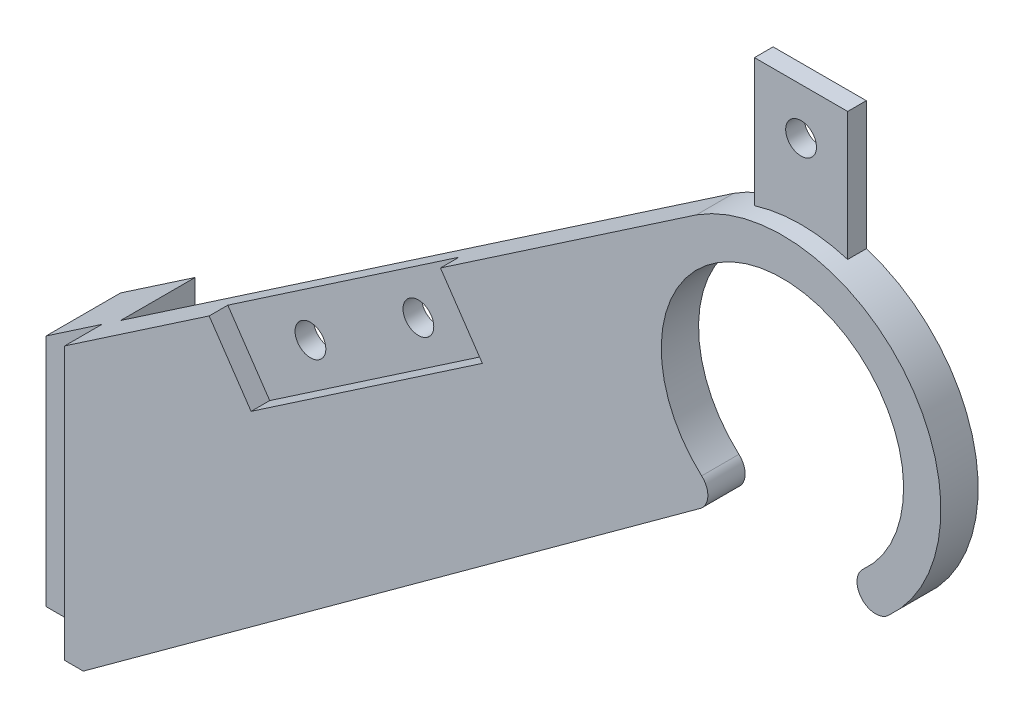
ISO-10303-21;
HEADER;
FILE_DESCRIPTION(('STEP AP214'),'2;1');
FILE_NAME('part.step','',(''),(''),'','','');
FILE_SCHEMA(('AUTOMOTIVE_DESIGN { 1 0 10303 214 1 1 1 1 }'));
ENDSEC;
DATA;
#1=APPLICATION_CONTEXT('core data for automotive mechanical design processes');
#2=APPLICATION_PROTOCOL_DEFINITION('international standard','automotive_design',2000,#1);
#3=PRODUCT_CONTEXT('',#1,'mechanical');
#4=PRODUCT('Part','Part','',(#3));
#5=PRODUCT_RELATED_PRODUCT_CATEGORY('part','',(#4));
#6=PRODUCT_DEFINITION_FORMATION('','',#4);
#7=PRODUCT_DEFINITION_CONTEXT('part definition',#1,'design');
#8=PRODUCT_DEFINITION('design','',#6,#7);
#9=PRODUCT_DEFINITION_SHAPE('','',#8);
#10=(LENGTH_UNIT() NAMED_UNIT(*) SI_UNIT(.MILLI.,.METRE.));
#11=(NAMED_UNIT(*) PLANE_ANGLE_UNIT() SI_UNIT($,.RADIAN.));
#12=(NAMED_UNIT(*) SI_UNIT($,.STERADIAN.) SOLID_ANGLE_UNIT());
#13=UNCERTAINTY_MEASURE_WITH_UNIT(LENGTH_MEASURE(1.E-05),#10,'distance_accuracy_value','');
#14=(GEOMETRIC_REPRESENTATION_CONTEXT(3) GLOBAL_UNCERTAINTY_ASSIGNED_CONTEXT((#13)) GLOBAL_UNIT_ASSIGNED_CONTEXT((#10,
#11,#12)) REPRESENTATION_CONTEXT('',''));
#15=CARTESIAN_POINT('',(0.,0.,0.));
#16=DIRECTION('',(0.,0.,1.));
#17=DIRECTION('',(1.,0.,0.));
#18=AXIS2_PLACEMENT_3D('',#15,#16,#17);
#19=CARTESIAN_POINT('',(-6.00000000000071,12.6393524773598,4.));
#20=DIRECTION('',(1.,0.,0.));
#21=DIRECTION('',(0.,1.,0.));
#22=AXIS2_PLACEMENT_3D('',#19,#20,#21);
#23=PLANE('',#22);
#24=CARTESIAN_POINT('',(-6.00000000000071,-5.86064752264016,-4.));
#25=DIRECTION('',(1.,0.,0.));
#26=DIRECTION('',(0.,0.,-1.));
#27=AXIS2_PLACEMENT_3D('',#24,#25,#26);
#28=CIRCLE('',#27,1.7);
#29=CARTESIAN_POINT('',(-6.00000000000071,-5.86064752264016,-5.7));
#30=VERTEX_POINT('',#29);
#31=EDGE_CURVE('E310',#30,#30,#28,.T.);
#32=ORIENTED_EDGE('',*,*,#31,.T.);
#33=EDGE_LOOP('',(#32));
#34=FACE_BOUND('',#33,.T.);
#35=CARTESIAN_POINT('',(-6.00000000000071,7.13935247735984,-4.));
#36=DIRECTION('',(1.,0.,0.));
#37=DIRECTION('',(0.,0.,-1.));
#38=AXIS2_PLACEMENT_3D('',#35,#36,#37);
#39=CIRCLE('',#38,1.7);
#40=CARTESIAN_POINT('',(-6.00000000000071,7.13935247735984,-5.7));
#41=VERTEX_POINT('',#40);
#42=EDGE_CURVE('E301',#41,#41,#39,.T.);
#43=ORIENTED_EDGE('',*,*,#42,.T.);
#44=EDGE_LOOP('',(#43));
#45=FACE_BOUND('',#44,.T.);
#46=DIRECTION('',(0.,-1.,0.));
#47=VECTOR('',#46,1.);
#48=CARTESIAN_POINT('',(-6.00000000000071,12.6393524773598,0.));
#49=LINE('',#48,#47);
#50=CARTESIAN_POINT('',(-6.00000000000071,12.6393524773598,0.));
#51=VERTEX_POINT('',#50);
#52=CARTESIAN_POINT('',(-6.00000000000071,-12.5000000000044,0.));
#53=VERTEX_POINT('',#52);
#54=EDGE_CURVE('E187',#51,#53,#49,.T.);
#55=ORIENTED_EDGE('',*,*,#54,.F.);
#56=DIRECTION('',(0.,0.,-1.));
#57=VECTOR('',#56,1.);
#58=CARTESIAN_POINT('',(-6.00000000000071,12.6393524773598,4.));
#59=LINE('',#58,#57);
#60=CARTESIAN_POINT('',(-6.00000000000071,12.6393524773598,-8.));
#61=VERTEX_POINT('',#60);
#62=EDGE_CURVE('E239',#51,#61,#59,.T.);
#63=ORIENTED_EDGE('',*,*,#62,.T.);
#64=DIRECTION('',(0.,1.,0.));
#65=VECTOR('',#64,1.);
#66=CARTESIAN_POINT('',(-6.00000000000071,12.6393524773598,-8.));
#67=LINE('',#66,#65);
#68=CARTESIAN_POINT('',(-6.00000000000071,-12.5000000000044,-8.));
#69=VERTEX_POINT('',#68);
#70=EDGE_CURVE('E322',#69,#61,#67,.T.);
#71=ORIENTED_EDGE('',*,*,#70,.F.);
#72=DIRECTION('',(0.,0.,-1.));
#73=VECTOR('',#72,1.);
#74=CARTESIAN_POINT('',(-6.00000000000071,-12.5000000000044,4.));
#75=LINE('',#74,#73);
#76=EDGE_CURVE('E237',#53,#69,#75,.T.);
#77=ORIENTED_EDGE('',*,*,#76,.F.);
#78=EDGE_LOOP('',(#55,#63,#71,#77));
#79=FACE_BOUND('',#78,.T.);
#80=ADVANCED_FACE('F39',(#34,#45,#79),#23,.F.);
#81=CARTESIAN_POINT('',(76.9999999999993,48.4999999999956,4.));
#82=DIRECTION('',(0.,0.,-1.));
#83=DIRECTION('',(-1.,0.,0.));
#84=AXIS2_PLACEMENT_3D('',#81,#82,#83);
#85=CYLINDRICAL_SURFACE('',#84,17.);
#86=DIRECTION('',(0.,0.,-1.));
#87=VECTOR('',#86,1.);
#88=CARTESIAN_POINT('',(81.9999999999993,64.7480768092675,2.));
#89=LINE('',#88,#87);
#90=CARTESIAN_POINT('',(81.9999999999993,64.7480768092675,2.));
#91=VERTEX_POINT('',#90);
#92=CARTESIAN_POINT('',(81.9999999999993,64.7480768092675,0.));
#93=VERTEX_POINT('',#92);
#94=EDGE_CURVE('E408',#91,#93,#89,.T.);
#95=ORIENTED_EDGE('',*,*,#94,.F.);
#96=CARTESIAN_POINT('',(76.9999999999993,48.4999999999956,2.));
#97=DIRECTION('',(0.,0.,-1.));
#98=DIRECTION('',(1.,0.,0.));
#99=AXIS2_PLACEMENT_3D('',#96,#97,#98);
#100=CIRCLE('',#99,17.);
#101=CARTESIAN_POINT('',(71.9999999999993,64.7480768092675,2.));
#102=VERTEX_POINT('',#101);
#103=EDGE_CURVE('E62',#102,#91,#100,.T.);
#104=ORIENTED_EDGE('',*,*,#103,.F.);
#105=DIRECTION('',(0.,0.,-1.));
#106=VECTOR('',#105,1.);
#107=CARTESIAN_POINT('',(71.9999999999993,64.7480768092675,2.));
#108=LINE('',#107,#106);
#109=CARTESIAN_POINT('',(71.9999999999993,64.7480768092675,0.));
#110=VERTEX_POINT('',#109);
#111=EDGE_CURVE('E416',#102,#110,#108,.T.);
#112=ORIENTED_EDGE('',*,*,#111,.T.);
#113=CARTESIAN_POINT('',(76.9999999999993,48.4999999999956,0.));
#114=DIRECTION('',(0.,0.,1.));
#115=DIRECTION('',(1.,0.,0.));
#116=AXIS2_PLACEMENT_3D('',#113,#114,#115);
#117=CIRCLE('',#116,17.);
#118=CARTESIAN_POINT('',(67.7706376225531,62.7765146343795,0.));
#119=VERTEX_POINT('',#118);
#120=EDGE_CURVE('E213',#110,#119,#117,.T.);
#121=ORIENTED_EDGE('',*,*,#120,.T.);
#122=DIRECTION('',(0.,0.,-1.));
#123=VECTOR('',#122,1.);
#124=CARTESIAN_POINT('',(67.7706376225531,62.7765146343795,4.));
#125=LINE('',#124,#123);
#126=CARTESIAN_POINT('',(67.7706376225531,62.7765146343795,4.));
#127=VERTEX_POINT('',#126);
#128=EDGE_CURVE('E241',#127,#119,#125,.T.);
#129=ORIENTED_EDGE('',*,*,#128,.F.);
#130=CARTESIAN_POINT('',(76.9999999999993,48.4999999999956,4.));
#131=DIRECTION('',(0.,0.,1.));
#132=DIRECTION('',(1.,0.,0.));
#133=AXIS2_PLACEMENT_3D('',#130,#131,#132);
#134=CIRCLE('',#133,17.);
#135=CARTESIAN_POINT('',(88.3333333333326,35.8289481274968,4.));
#136=VERTEX_POINT('',#135);
#137=EDGE_CURVE('E194',#136,#127,#134,.T.);
#138=ORIENTED_EDGE('',*,*,#137,.F.);
#139=DIRECTION('',(0.,0.,-1.));
#140=VECTOR('',#139,1.);
#141=CARTESIAN_POINT('',(88.3333333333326,35.8289481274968,4.));
#142=LINE('',#141,#140);
#143=CARTESIAN_POINT('',(88.3333333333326,35.8289481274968,0.));
#144=VERTEX_POINT('',#143);
#145=EDGE_CURVE('E178',#136,#144,#142,.T.);
#146=ORIENTED_EDGE('',*,*,#145,.T.);
#147=EDGE_CURVE('E215',#144,#93,#117,.T.);
#148=ORIENTED_EDGE('',*,*,#147,.T.);
#149=EDGE_LOOP('',(#95,#104,#112,#121,#129,#138,#146,#148));
#150=FACE_BOUND('',#149,.T.);
#151=ADVANCED_FACE('F339',(#150),#85,.T.);
#152=CARTESIAN_POINT('',(0.,0.,2.));
#153=DIRECTION('',(0.,0.,-1.));
#154=DIRECTION('',(-1.,0.,0.));
#155=AXIS2_PLACEMENT_3D('',#152,#153,#154);
#156=PLANE('',#155);
#157=CARTESIAN_POINT('',(24.3681164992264,28.4422397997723,2.));
#158=DIRECTION('',(0.,0.,1.));
#159=DIRECTION('',(1.,0.,0.));
#160=AXIS2_PLACEMENT_3D('',#157,#158,#159);
#161=CIRCLE('',#160,1.65);
#162=CARTESIAN_POINT('',(26.0181164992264,28.4422397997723,2.));
#163=VERTEX_POINT('',#162);
#164=EDGE_CURVE('E249',#163,#163,#161,.T.);
#165=ORIENTED_EDGE('',*,*,#164,.F.);
#166=EDGE_LOOP('',(#165));
#167=FACE_BOUND('',#166,.T.);
#168=DIRECTION('',(0.56210399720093,-0.827066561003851,0.));
#169=VECTOR('',#168,1.);
#170=CARTESIAN_POINT('',(19.9999999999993,20.6371415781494,2.));
#171=LINE('',#170,#169);
#172=CARTESIAN_POINT('',(15.5031680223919,27.2536740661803,2.));
#173=VERTEX_POINT('',#172);
#174=CARTESIAN_POINT('',(19.9999999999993,20.6371415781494,2.));
#175=VERTEX_POINT('',#174);
#176=EDGE_CURVE('E267',#173,#175,#171,.T.);
#177=ORIENTED_EDGE('',*,*,#176,.T.);
#178=DIRECTION('',(0.827066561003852,0.562103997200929,0.));
#179=VECTOR('',#178,1.);
#180=CARTESIAN_POINT('',(44.8119968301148,37.5002614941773,2.));
#181=LINE('',#180,#179);
#182=CARTESIAN_POINT('',(44.8119968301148,37.5002614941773,2.));
#183=VERTEX_POINT('',#182);
#184=EDGE_CURVE('E270',#175,#183,#181,.T.);
#185=ORIENTED_EDGE('',*,*,#184,.T.);
#186=DIRECTION('',(-0.562103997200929,0.827066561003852,0.));
#187=VECTOR('',#186,1.);
#188=CARTESIAN_POINT('',(40.3151648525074,44.1167939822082,2.));
#189=LINE('',#188,#187);
#190=CARTESIAN_POINT('',(40.3151648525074,44.1167939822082,2.));
#191=VERTEX_POINT('',#190);
#192=EDGE_CURVE('E274',#183,#191,#189,.T.);
#193=ORIENTED_EDGE('',*,*,#192,.T.);
#194=DIRECTION('',(-0.827066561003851,-0.56210399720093,0.));
#195=VECTOR('',#194,1.);
#196=CARTESIAN_POINT('',(15.5031680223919,27.2536740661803,2.));
#197=LINE('',#196,#195);
#198=EDGE_CURVE('E277',#191,#173,#197,.T.);
#199=ORIENTED_EDGE('',*,*,#198,.T.);
#200=EDGE_LOOP('',(#177,#185,#193,#199));
#201=FACE_BOUND('',#200,.T.);
#202=CARTESIAN_POINT('',(35.9470483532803,36.3116957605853,2.));
#203=DIRECTION('',(0.,0.,1.));
#204=DIRECTION('',(1.,0.,0.));
#205=AXIS2_PLACEMENT_3D('',#202,#203,#204);
#206=CIRCLE('',#205,1.65);
#207=CARTESIAN_POINT('',(37.5970483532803,36.3116957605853,2.));
#208=VERTEX_POINT('',#207);
#209=EDGE_CURVE('E248',#208,#208,#206,.T.);
#210=ORIENTED_EDGE('',*,*,#209,.F.);
#211=EDGE_LOOP('',(#210));
#212=FACE_BOUND('',#211,.T.);
#213=ADVANCED_FACE('F354',(#167,#201,#212),#156,.F.);
#214=CARTESIAN_POINT('',(86.9999999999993,37.3196601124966,0.));
#215=DIRECTION('',(0.,0.,1.));
#216=DIRECTION('',(1.,0.,0.));
#217=AXIS2_PLACEMENT_3D('',#214,#215,#216);
#218=PLANE('',#217);
#219=CARTESIAN_POINT('',(76.9999999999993,73.4999999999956,0.));
#220=DIRECTION('',(0.,0.,1.));
#221=DIRECTION('',(1.,0.,0.));
#222=AXIS2_PLACEMENT_3D('',#219,#220,#221);
#223=CIRCLE('',#222,1.64999999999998);
#224=CARTESIAN_POINT('',(78.6499999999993,73.4999999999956,0.));
#225=VERTEX_POINT('',#224);
#226=EDGE_CURVE('E395',#225,#225,#223,.T.);
#227=ORIENTED_EDGE('',*,*,#226,.T.);
#228=EDGE_LOOP('',(#227));
#229=FACE_BOUND('',#228,.T.);
#230=CARTESIAN_POINT('',(24.3681164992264,28.4422397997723,0.));
#231=DIRECTION('',(0.,0.,1.));
#232=DIRECTION('',(1.,0.,0.));
#233=AXIS2_PLACEMENT_3D('',#230,#231,#232);
#234=CIRCLE('',#233,1.65);
#235=CARTESIAN_POINT('',(26.0181164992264,28.4422397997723,0.));
#236=VERTEX_POINT('',#235);
#237=EDGE_CURVE('E246',#236,#236,#234,.T.);
#238=ORIENTED_EDGE('',*,*,#237,.T.);
#239=EDGE_LOOP('',(#238));
#240=FACE_BOUND('',#239,.T.);
#241=CARTESIAN_POINT('',(35.9470483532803,36.3116957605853,0.));
#242=DIRECTION('',(0.,0.,1.));
#243=DIRECTION('',(1.,0.,0.));
#244=AXIS2_PLACEMENT_3D('',#241,#242,#243);
#245=CIRCLE('',#244,1.65);
#246=CARTESIAN_POINT('',(37.5970483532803,36.3116957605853,0.));
#247=VERTEX_POINT('',#246);
#248=EDGE_CURVE('E253',#247,#247,#245,.T.);
#249=ORIENTED_EDGE('',*,*,#248,.T.);
#250=EDGE_LOOP('',(#249));
#251=FACE_BOUND('',#250,.T.);
#252=DIRECTION('',(0.,-1.,0.));
#253=VECTOR('',#252,1.);
#254=CARTESIAN_POINT('',(1.99999999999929,12.6393524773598,0.));
#255=LINE('',#254,#253);
#256=CARTESIAN_POINT('',(1.99999999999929,18.0764384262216,0.));
#257=VERTEX_POINT('',#256);
#258=CARTESIAN_POINT('',(1.99999999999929,-12.5000000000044,0.));
#259=VERTEX_POINT('',#258);
#260=EDGE_CURVE('E313',#257,#259,#255,.T.);
#261=ORIENTED_EDGE('',*,*,#260,.F.);
#262=DIRECTION('',(-0.827066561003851,-0.562103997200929,0.));
#263=VECTOR('',#262,1.);
#264=CARTESIAN_POINT('',(-6.00000000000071,12.6393524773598,0.));
#265=LINE('',#264,#263);
#266=EDGE_CURVE('E217',#119,#257,#265,.T.);
#267=ORIENTED_EDGE('',*,*,#266,.F.);
#268=ORIENTED_EDGE('',*,*,#120,.F.);
#269=DIRECTION('',(0.,-1.,0.));
#270=VECTOR('',#269,1.);
#271=CARTESIAN_POINT('',(71.9999999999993,64.7480768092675,0.));
#272=LINE('',#271,#270);
#273=CARTESIAN_POINT('',(71.9999999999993,78.4999999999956,0.));
#274=VERTEX_POINT('',#273);
#275=EDGE_CURVE('E403',#274,#110,#272,.T.);
#276=ORIENTED_EDGE('',*,*,#275,.F.);
#277=DIRECTION('',(-1.,0.,0.));
#278=VECTOR('',#277,1.);
#279=CARTESIAN_POINT('',(71.9999999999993,78.4999999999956,0.));
#280=LINE('',#279,#278);
#281=CARTESIAN_POINT('',(81.9999999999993,78.4999999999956,0.));
#282=VERTEX_POINT('',#281);
#283=EDGE_CURVE('E411',#282,#274,#280,.T.);
#284=ORIENTED_EDGE('',*,*,#283,.F.);
#285=DIRECTION('',(0.,1.,0.));
#286=VECTOR('',#285,1.);
#287=CARTESIAN_POINT('',(81.9999999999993,64.7480768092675,0.));
#288=LINE('',#287,#286);
#289=EDGE_CURVE('E398',#93,#282,#288,.T.);
#290=ORIENTED_EDGE('',*,*,#289,.F.);
#291=ORIENTED_EDGE('',*,*,#147,.F.);
#292=CARTESIAN_POINT('',(86.9999999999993,37.3196601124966,0.));
#293=DIRECTION('',(0.,0.,1.));
#294=DIRECTION('',(1.,0.,0.));
#295=AXIS2_PLACEMENT_3D('',#292,#293,#294);
#296=CIRCLE('',#295,2.00000000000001);
#297=CARTESIAN_POINT('',(85.666666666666,38.8103720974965,0.));
#298=VERTEX_POINT('',#297);
#299=EDGE_CURVE('E210',#298,#144,#296,.T.);
#300=ORIENTED_EDGE('',*,*,#299,.F.);
#301=CARTESIAN_POINT('',(76.9999999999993,48.4999999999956,0.));
#302=DIRECTION('',(0.,0.,-1.));
#303=DIRECTION('',(1.,0.,0.));
#304=AXIS2_PLACEMENT_3D('',#301,#302,#303);
#305=CIRCLE('',#304,13.);
#306=CARTESIAN_POINT('',(68.3333333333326,38.8103720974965,0.));
#307=VERTEX_POINT('',#306);
#308=EDGE_CURVE('E224',#307,#298,#305,.T.);
#309=ORIENTED_EDGE('',*,*,#308,.F.);
#310=CARTESIAN_POINT('',(66.9999999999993,37.3196601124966,0.));
#311=DIRECTION('',(0.,0.,1.));
#312=DIRECTION('',(1.,0.,0.));
#313=AXIS2_PLACEMENT_3D('',#310,#311,#312);
#314=CIRCLE('',#313,2.);
#315=CARTESIAN_POINT('',(68.177524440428,35.7030475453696,0.));
#316=VERTEX_POINT('',#315);
#317=EDGE_CURVE('E222',#316,#307,#314,.T.);
#318=ORIENTED_EDGE('',*,*,#317,.F.);
#319=DIRECTION('',(0.808306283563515,0.588762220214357,0.));
#320=VECTOR('',#319,1.);
#321=CARTESIAN_POINT('',(1.99999999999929,-12.5000000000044,0.));
#322=LINE('',#321,#320);
#323=EDGE_CURVE('E220',#259,#316,#322,.T.);
#324=ORIENTED_EDGE('',*,*,#323,.F.);
#325=EDGE_LOOP('',(#261,#267,#268,#276,#284,#290,#291,#300,#309,#318,#324));
#326=FACE_BOUND('',#325,.T.);
#327=ADVANCED_FACE('F357',(#229,#240,#251,#326),#218,.F.);
#328=CARTESIAN_POINT('',(86.9999999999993,37.3196601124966,4.));
#329=DIRECTION('',(0.,0.,-1.));
#330=DIRECTION('',(-1.,0.,0.));
#331=AXIS2_PLACEMENT_3D('',#328,#329,#330);
#332=CYLINDRICAL_SURFACE('',#331,2.00000000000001);
#333=ORIENTED_EDGE('',*,*,#299,.T.);
#334=ORIENTED_EDGE('',*,*,#145,.F.);
#335=CARTESIAN_POINT('',(86.9999999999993,37.3196601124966,4.));
#336=DIRECTION('',(0.,0.,1.));
#337=DIRECTION('',(1.,0.,0.));
#338=AXIS2_PLACEMENT_3D('',#335,#336,#337);
#339=CIRCLE('',#338,2.00000000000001);
#340=CARTESIAN_POINT('',(85.666666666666,38.8103720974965,4.));
#341=VERTEX_POINT('',#340);
#342=EDGE_CURVE('E198',#341,#136,#339,.T.);
#343=ORIENTED_EDGE('',*,*,#342,.F.);
#344=DIRECTION('',(0.,0.,-1.));
#345=VECTOR('',#344,1.);
#346=CARTESIAN_POINT('',(85.666666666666,38.8103720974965,4.));
#347=LINE('',#346,#345);
#348=EDGE_CURVE('E209',#341,#298,#347,.T.);
#349=ORIENTED_EDGE('',*,*,#348,.T.);
#350=EDGE_LOOP('',(#333,#334,#343,#349));
#351=FACE_BOUND('',#350,.T.);
#352=ADVANCED_FACE('F41',(#351),#332,.T.);
#353=CARTESIAN_POINT('',(-6.00000000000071,12.6393524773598,4.));
#354=DIRECTION('',(0.562103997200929,-0.827066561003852,0.));
#355=DIRECTION('',(0.827066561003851,0.562103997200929,0.));
#356=AXIS2_PLACEMENT_3D('',#353,#354,#355);
#357=PLANE('',#356);
#358=DIRECTION('',(-0.827066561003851,-0.562103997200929,0.));
#359=VECTOR('',#358,1.);
#360=CARTESIAN_POINT('',(-6.00000000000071,12.6393524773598,0.));
#361=LINE('',#360,#359);
#362=CARTESIAN_POINT('',(0.,16.7171669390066,0.));
#363=VERTEX_POINT('',#362);
#364=EDGE_CURVE('E186',#363,#51,#361,.T.);
#365=ORIENTED_EDGE('',*,*,#364,.F.);
#366=DIRECTION('',(0.,0.,1.));
#367=VECTOR('',#366,1.);
#368=CARTESIAN_POINT('',(0.,16.7171669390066,4.));
#369=LINE('',#368,#367);
#370=CARTESIAN_POINT('',(0.,16.7171669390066,4.));
#371=VERTEX_POINT('',#370);
#372=EDGE_CURVE('E173',#363,#371,#369,.T.);
#373=ORIENTED_EDGE('',*,*,#372,.T.);
#374=DIRECTION('',(-0.827066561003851,-0.562103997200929,0.));
#375=VECTOR('',#374,1.);
#376=CARTESIAN_POINT('',(-6.00000000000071,12.6393524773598,4.));
#377=LINE('',#376,#375);
#378=CARTESIAN_POINT('',(15.5031680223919,27.2536740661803,4.));
#379=VERTEX_POINT('',#378);
#380=EDGE_CURVE('E184',#379,#371,#377,.T.);
#381=ORIENTED_EDGE('',*,*,#380,.F.);
#382=DIRECTION('',(0.,0.,1.));
#383=VECTOR('',#382,1.);
#384=CARTESIAN_POINT('',(15.5031680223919,27.2536740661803,2.));
#385=LINE('',#384,#383);
#386=EDGE_CURVE('E286',#173,#379,#385,.T.);
#387=ORIENTED_EDGE('',*,*,#386,.F.);
#388=ORIENTED_EDGE('',*,*,#198,.F.);
#389=DIRECTION('',(0.,0.,1.));
#390=VECTOR('',#389,1.);
#391=CARTESIAN_POINT('',(40.3151648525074,44.1167939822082,2.));
#392=LINE('',#391,#390);
#393=CARTESIAN_POINT('',(40.3151648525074,44.1167939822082,4.));
#394=VERTEX_POINT('',#393);
#395=EDGE_CURVE('E289',#191,#394,#392,.T.);
#396=ORIENTED_EDGE('',*,*,#395,.T.);
#397=EDGE_CURVE('E193',#127,#394,#377,.T.);
#398=ORIENTED_EDGE('',*,*,#397,.F.);
#399=ORIENTED_EDGE('',*,*,#128,.T.);
#400=ORIENTED_EDGE('',*,*,#266,.T.);
#401=DIRECTION('',(0.,0.,1.));
#402=VECTOR('',#401,1.);
#403=CARTESIAN_POINT('',(1.9999999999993,18.0764384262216,-8.));
#404=LINE('',#403,#402);
#405=CARTESIAN_POINT('',(1.9999999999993,18.0764384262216,-8.));
#406=VERTEX_POINT('',#405);
#407=EDGE_CURVE('E214',#406,#257,#404,.T.);
#408=ORIENTED_EDGE('',*,*,#407,.F.);
#409=DIRECTION('',(0.827066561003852,0.562103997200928,0.));
#410=VECTOR('',#409,1.);
#411=CARTESIAN_POINT('',(1.9999999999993,18.0764384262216,-8.));
#412=LINE('',#411,#410);
#413=EDGE_CURVE('E314',#61,#406,#412,.T.);
#414=ORIENTED_EDGE('',*,*,#413,.F.);
#415=ORIENTED_EDGE('',*,*,#62,.F.);
#416=EDGE_LOOP('',(#365,#373,#381,#387,#388,#396,#398,#399,#400,#408,#414,#415));
#417=FACE_BOUND('',#416,.T.);
#418=ADVANCED_FACE('F182',(#417),#357,.F.);
#419=CARTESIAN_POINT('',(-6.00000000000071,-12.5000000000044,4.));
#420=DIRECTION('',(0.,1.,0.));
#421=DIRECTION('',(-1.,0.,0.));
#422=AXIS2_PLACEMENT_3D('',#419,#420,#421);
#423=PLANE('',#422);
#424=DIRECTION('',(1.,0.,0.));
#425=VECTOR('',#424,1.);
#426=CARTESIAN_POINT('',(-6.00000000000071,-12.5000000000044,4.));
#427=LINE('',#426,#425);
#428=CARTESIAN_POINT('',(0.,-12.5000000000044,4.));
#429=VERTEX_POINT('',#428);
#430=CARTESIAN_POINT('',(1.99999999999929,-12.5000000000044,4.));
#431=VERTEX_POINT('',#430);
#432=EDGE_CURVE('E197',#429,#431,#427,.T.);
#433=ORIENTED_EDGE('',*,*,#432,.F.);
#434=DIRECTION('',(0.,0.,-1.));
#435=VECTOR('',#434,1.);
#436=CARTESIAN_POINT('',(0.,-12.5000000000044,4.));
#437=LINE('',#436,#435);
#438=CARTESIAN_POINT('',(0.,-12.5000000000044,0.));
#439=VERTEX_POINT('',#438);
#440=EDGE_CURVE('E54',#429,#439,#437,.T.);
#441=ORIENTED_EDGE('',*,*,#440,.T.);
#442=DIRECTION('',(1.,0.,0.));
#443=VECTOR('',#442,1.);
#444=CARTESIAN_POINT('',(-6.00000000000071,-12.5000000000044,0.));
#445=LINE('',#444,#443);
#446=EDGE_CURVE('E12',#53,#439,#445,.T.);
#447=ORIENTED_EDGE('',*,*,#446,.F.);
#448=ORIENTED_EDGE('',*,*,#76,.T.);
#449=DIRECTION('',(-1.,0.,0.));
#450=VECTOR('',#449,1.);
#451=CARTESIAN_POINT('',(-6.00000000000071,-12.5000000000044,-8.));
#452=LINE('',#451,#450);
#453=CARTESIAN_POINT('',(1.99999999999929,-12.5000000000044,-8.));
#454=VERTEX_POINT('',#453);
#455=EDGE_CURVE('E319',#454,#69,#452,.T.);
#456=ORIENTED_EDGE('',*,*,#455,.F.);
#457=DIRECTION('',(0.,0.,1.));
#458=VECTOR('',#457,1.);
#459=CARTESIAN_POINT('',(1.99999999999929,-12.5000000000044,-8.));
#460=LINE('',#459,#458);
#461=EDGE_CURVE('E325',#454,#259,#460,.T.);
#462=ORIENTED_EDGE('',*,*,#461,.T.);
#463=DIRECTION('',(0.,0.,-1.));
#464=VECTOR('',#463,1.);
#465=CARTESIAN_POINT('',(1.99999999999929,-12.5000000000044,4.));
#466=LINE('',#465,#464);
#467=EDGE_CURVE('E234',#431,#259,#466,.T.);
#468=ORIENTED_EDGE('',*,*,#467,.F.);
#469=EDGE_LOOP('',(#433,#441,#447,#448,#456,#462,#468));
#470=FACE_BOUND('',#469,.T.);
#471=ADVANCED_FACE('F457',(#470),#423,.F.);
#472=CARTESIAN_POINT('',(1.99999999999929,-12.5000000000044,4.));
#473=DIRECTION('',(-0.588762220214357,0.808306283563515,0.));
#474=DIRECTION('',(-0.808306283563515,-0.588762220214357,0.));
#475=AXIS2_PLACEMENT_3D('',#472,#473,#474);
#476=PLANE('',#475);
#477=ORIENTED_EDGE('',*,*,#323,.T.);
#478=DIRECTION('',(0.,0.,-1.));
#479=VECTOR('',#478,1.);
#480=CARTESIAN_POINT('',(68.177524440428,35.7030475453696,4.));
#481=LINE('',#480,#479);
#482=CARTESIAN_POINT('',(68.177524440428,35.7030475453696,4.));
#483=VERTEX_POINT('',#482);
#484=EDGE_CURVE('E231',#483,#316,#481,.T.);
#485=ORIENTED_EDGE('',*,*,#484,.F.);
#486=DIRECTION('',(0.808306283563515,0.588762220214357,0.));
#487=VECTOR('',#486,1.);
#488=CARTESIAN_POINT('',(1.99999999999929,-12.5000000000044,4.));
#489=LINE('',#488,#487);
#490=EDGE_CURVE('E203',#431,#483,#489,.T.);
#491=ORIENTED_EDGE('',*,*,#490,.F.);
#492=ORIENTED_EDGE('',*,*,#467,.T.);
#493=EDGE_LOOP('',(#477,#485,#491,#492));
#494=FACE_BOUND('',#493,.T.);
#495=ADVANCED_FACE('F462',(#494),#476,.F.);
#496=CARTESIAN_POINT('',(66.9999999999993,37.3196601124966,4.));
#497=DIRECTION('',(0.,0.,-1.));
#498=DIRECTION('',(-1.,0.,0.));
#499=AXIS2_PLACEMENT_3D('',#496,#497,#498);
#500=CYLINDRICAL_SURFACE('',#499,2.);
#501=ORIENTED_EDGE('',*,*,#317,.T.);
#502=DIRECTION('',(0.,0.,-1.));
#503=VECTOR('',#502,1.);
#504=CARTESIAN_POINT('',(68.3333333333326,38.8103720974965,4.));
#505=LINE('',#504,#503);
#506=CARTESIAN_POINT('',(68.3333333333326,38.8103720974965,4.));
#507=VERTEX_POINT('',#506);
#508=EDGE_CURVE('E228',#507,#307,#505,.T.);
#509=ORIENTED_EDGE('',*,*,#508,.F.);
#510=CARTESIAN_POINT('',(66.9999999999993,37.3196601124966,4.));
#511=DIRECTION('',(0.,0.,1.));
#512=DIRECTION('',(1.,0.,0.));
#513=AXIS2_PLACEMENT_3D('',#510,#511,#512);
#514=CIRCLE('',#513,2.);
#515=EDGE_CURVE('E205',#483,#507,#514,.T.);
#516=ORIENTED_EDGE('',*,*,#515,.F.);
#517=ORIENTED_EDGE('',*,*,#484,.T.);
#518=EDGE_LOOP('',(#501,#509,#516,#517));
#519=FACE_BOUND('',#518,.T.);
#520=ADVANCED_FACE('F490',(#519),#500,.T.);
#521=CARTESIAN_POINT('',(76.9999999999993,48.4999999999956,4.));
#522=DIRECTION('',(0.,0.,-1.));
#523=DIRECTION('',(-1.,0.,0.));
#524=AXIS2_PLACEMENT_3D('',#521,#522,#523);
#525=CYLINDRICAL_SURFACE('',#524,13.);
#526=ORIENTED_EDGE('',*,*,#308,.T.);
#527=ORIENTED_EDGE('',*,*,#348,.F.);
#528=CARTESIAN_POINT('',(76.9999999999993,48.4999999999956,4.));
#529=DIRECTION('',(0.,0.,-1.));
#530=DIRECTION('',(1.,0.,0.));
#531=AXIS2_PLACEMENT_3D('',#528,#529,#530);
#532=CIRCLE('',#531,13.);
#533=EDGE_CURVE('E207',#507,#341,#532,.T.);
#534=ORIENTED_EDGE('',*,*,#533,.F.);
#535=ORIENTED_EDGE('',*,*,#508,.T.);
#536=EDGE_LOOP('',(#526,#527,#534,#535));
#537=FACE_BOUND('',#536,.T.);
#538=ADVANCED_FACE('F497',(#537),#525,.F.);
#539=CARTESIAN_POINT('',(86.9999999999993,37.3196601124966,4.));
#540=DIRECTION('',(0.,0.,1.));
#541=DIRECTION('',(1.,0.,0.));
#542=AXIS2_PLACEMENT_3D('',#539,#540,#541);
#543=PLANE('',#542);
#544=DIRECTION('',(0.,1.,0.));
#545=VECTOR('',#544,1.);
#546=CARTESIAN_POINT('',(0.,37.3196601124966,4.));
#547=LINE('',#546,#545);
#548=EDGE_CURVE('E47',#429,#371,#547,.T.);
#549=ORIENTED_EDGE('',*,*,#548,.F.);
#550=ORIENTED_EDGE('',*,*,#432,.T.);
#551=ORIENTED_EDGE('',*,*,#490,.T.);
#552=ORIENTED_EDGE('',*,*,#515,.T.);
#553=ORIENTED_EDGE('',*,*,#533,.T.);
#554=ORIENTED_EDGE('',*,*,#342,.T.);
#555=ORIENTED_EDGE('',*,*,#137,.T.);
#556=ORIENTED_EDGE('',*,*,#397,.T.);
#557=DIRECTION('',(-0.562103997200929,0.827066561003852,0.));
#558=VECTOR('',#557,1.);
#559=CARTESIAN_POINT('',(40.3151648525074,44.1167939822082,4.));
#560=LINE('',#559,#558);
#561=CARTESIAN_POINT('',(44.8119968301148,37.5002614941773,4.));
#562=VERTEX_POINT('',#561);
#563=EDGE_CURVE('E271',#562,#394,#560,.T.);
#564=ORIENTED_EDGE('',*,*,#563,.F.);
#565=DIRECTION('',(0.827066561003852,0.562103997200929,0.));
#566=VECTOR('',#565,1.);
#567=CARTESIAN_POINT('',(44.8119968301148,37.5002614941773,4.));
#568=LINE('',#567,#566);
#569=CARTESIAN_POINT('',(19.9999999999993,20.6371415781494,4.));
#570=VERTEX_POINT('',#569);
#571=EDGE_CURVE('E282',#570,#562,#568,.T.);
#572=ORIENTED_EDGE('',*,*,#571,.F.);
#573=DIRECTION('',(0.56210399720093,-0.827066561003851,0.));
#574=VECTOR('',#573,1.);
#575=CARTESIAN_POINT('',(19.9999999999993,20.6371415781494,4.));
#576=LINE('',#575,#574);
#577=EDGE_CURVE('E192',#379,#570,#576,.T.);
#578=ORIENTED_EDGE('',*,*,#577,.F.);
#579=ORIENTED_EDGE('',*,*,#380,.T.);
#580=EDGE_LOOP('',(#549,#550,#551,#552,#553,#554,#555,#556,#564,#572,#578,#579));
#581=FACE_BOUND('',#580,.T.);
#582=ADVANCED_FACE('F190',(#581),#543,.T.);
#583=CARTESIAN_POINT('',(1.99999999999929,12.6393524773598,-8.));
#584=DIRECTION('',(-1.,0.,0.));
#585=DIRECTION('',(0.,0.,1.));
#586=AXIS2_PLACEMENT_3D('',#583,#584,#585);
#587=PLANE('',#586);
#588=CARTESIAN_POINT('',(1.99999999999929,7.13935247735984,-4.));
#589=DIRECTION('',(1.,0.,0.));
#590=DIRECTION('',(0.,0.,-1.));
#591=AXIS2_PLACEMENT_3D('',#588,#589,#590);
#592=CIRCLE('',#591,3.3);
#593=CARTESIAN_POINT('',(1.99999999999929,7.13935247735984,-7.3));
#594=VERTEX_POINT('',#593);
#595=EDGE_CURVE('E288',#594,#594,#592,.T.);
#596=ORIENTED_EDGE('',*,*,#595,.F.);
#597=EDGE_LOOP('',(#596));
#598=FACE_BOUND('',#597,.T.);
#599=CARTESIAN_POINT('',(1.99999999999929,-5.86064752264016,-4.));
#600=DIRECTION('',(1.,0.,0.));
#601=DIRECTION('',(0.,0.,-1.));
#602=AXIS2_PLACEMENT_3D('',#599,#600,#601);
#603=CIRCLE('',#602,3.3);
#604=CARTESIAN_POINT('',(1.99999999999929,-5.86064752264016,-7.3));
#605=VERTEX_POINT('',#604);
#606=EDGE_CURVE('E304',#605,#605,#603,.T.);
#607=ORIENTED_EDGE('',*,*,#606,.F.);
#608=EDGE_LOOP('',(#607));
#609=FACE_BOUND('',#608,.T.);
#610=ORIENTED_EDGE('',*,*,#260,.T.);
#611=ORIENTED_EDGE('',*,*,#461,.F.);
#612=DIRECTION('',(0.,-1.,0.));
#613=VECTOR('',#612,1.);
#614=CARTESIAN_POINT('',(1.99999999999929,12.6393524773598,-8.));
#615=LINE('',#614,#613);
#616=EDGE_CURVE('E317',#406,#454,#615,.T.);
#617=ORIENTED_EDGE('',*,*,#616,.F.);
#618=ORIENTED_EDGE('',*,*,#407,.T.);
#619=EDGE_LOOP('',(#610,#611,#617,#618));
#620=FACE_BOUND('',#619,.T.);
#621=ADVANCED_FACE('F378',(#598,#609,#620),#587,.F.);
#622=CARTESIAN_POINT('',(0.,0.,-8.));
#623=DIRECTION('',(0.,0.,1.));
#624=DIRECTION('',(1.,0.,0.));
#625=AXIS2_PLACEMENT_3D('',#622,#623,#624);
#626=PLANE('',#625);
#627=ORIENTED_EDGE('',*,*,#413,.T.);
#628=ORIENTED_EDGE('',*,*,#616,.T.);
#629=ORIENTED_EDGE('',*,*,#455,.T.);
#630=ORIENTED_EDGE('',*,*,#70,.T.);
#631=EDGE_LOOP('',(#627,#628,#629,#630));
#632=FACE_BOUND('',#631,.T.);
#633=ADVANCED_FACE('F381',(#632),#626,.F.);
#634=CARTESIAN_POINT('',(1.99999999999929,-5.86064752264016,-4.));
#635=DIRECTION('',(1.,0.,0.));
#636=DIRECTION('',(0.,0.,-1.));
#637=AXIS2_PLACEMENT_3D('',#634,#635,#636);
#638=CYLINDRICAL_SURFACE('',#637,1.69999999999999);
#639=ORIENTED_EDGE('',*,*,#31,.F.);
#640=EDGE_LOOP('',(#639));
#641=FACE_BOUND('',#640,.T.);
#642=CARTESIAN_POINT('',(0.399999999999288,-5.86064752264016,-4.));
#643=DIRECTION('',(1.,0.,0.));
#644=DIRECTION('',(0.,0.,-1.));
#645=AXIS2_PLACEMENT_3D('',#642,#643,#644);
#646=CIRCLE('',#645,1.69999999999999);
#647=CARTESIAN_POINT('',(0.399999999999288,-5.86064752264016,-5.69999999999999));
#648=VERTEX_POINT('',#647);
#649=EDGE_CURVE('E307',#648,#648,#646,.T.);
#650=ORIENTED_EDGE('',*,*,#649,.T.);
#651=EDGE_LOOP('',(#650));
#652=FACE_BOUND('',#651,.T.);
#653=ADVANCED_FACE('F529',(#641,#652),#638,.F.);
#654=CARTESIAN_POINT('',(1.99999999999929,-5.86064752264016,-4.));
#655=DIRECTION('',(1.,0.,0.));
#656=DIRECTION('',(0.,0.,-1.));
#657=AXIS2_PLACEMENT_3D('',#654,#655,#656);
#658=CONICAL_SURFACE('',#657,3.3,0.78539816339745);
#659=ORIENTED_EDGE('',*,*,#649,.F.);
#660=EDGE_LOOP('',(#659));
#661=FACE_BOUND('',#660,.T.);
#662=ORIENTED_EDGE('',*,*,#606,.T.);
#663=EDGE_LOOP('',(#662));
#664=FACE_BOUND('',#663,.T.);
#665=ADVANCED_FACE('F535',(#661,#664),#658,.F.);
#666=CARTESIAN_POINT('',(1.99999999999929,7.13935247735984,-4.));
#667=DIRECTION('',(1.,0.,0.));
#668=DIRECTION('',(0.,0.,-1.));
#669=AXIS2_PLACEMENT_3D('',#666,#667,#668);
#670=CYLINDRICAL_SURFACE('',#669,1.69999999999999);
#671=ORIENTED_EDGE('',*,*,#42,.F.);
#672=EDGE_LOOP('',(#671));
#673=FACE_BOUND('',#672,.T.);
#674=CARTESIAN_POINT('',(0.399999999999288,7.13935247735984,-4.));
#675=DIRECTION('',(1.,0.,0.));
#676=DIRECTION('',(0.,0.,-1.));
#677=AXIS2_PLACEMENT_3D('',#674,#675,#676);
#678=CIRCLE('',#677,1.69999999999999);
#679=CARTESIAN_POINT('',(0.399999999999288,7.13935247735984,-5.69999999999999));
#680=VERTEX_POINT('',#679);
#681=EDGE_CURVE('E298',#680,#680,#678,.T.);
#682=ORIENTED_EDGE('',*,*,#681,.T.);
#683=EDGE_LOOP('',(#682));
#684=FACE_BOUND('',#683,.T.);
#685=ADVANCED_FACE('F543',(#673,#684),#670,.F.);
#686=CARTESIAN_POINT('',(1.99999999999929,7.13935247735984,-4.));
#687=DIRECTION('',(1.,0.,0.));
#688=DIRECTION('',(0.,0.,-1.));
#689=AXIS2_PLACEMENT_3D('',#686,#687,#688);
#690=CONICAL_SURFACE('',#689,3.3,0.78539816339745);
#691=ORIENTED_EDGE('',*,*,#681,.F.);
#692=EDGE_LOOP('',(#691));
#693=FACE_BOUND('',#692,.T.);
#694=ORIENTED_EDGE('',*,*,#595,.T.);
#695=EDGE_LOOP('',(#694));
#696=FACE_BOUND('',#695,.T.);
#697=ADVANCED_FACE('F551',(#693,#696),#690,.F.);
#698=CARTESIAN_POINT('',(19.9999999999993,20.6371415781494,2.));
#699=DIRECTION('',(-0.827066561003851,-0.56210399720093,0.));
#700=DIRECTION('',(0.56210399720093,-0.827066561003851,0.));
#701=AXIS2_PLACEMENT_3D('',#698,#699,#700);
#702=PLANE('',#701);
#703=ORIENTED_EDGE('',*,*,#577,.T.);
#704=DIRECTION('',(0.,0.,1.));
#705=VECTOR('',#704,1.);
#706=CARTESIAN_POINT('',(19.9999999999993,20.6371415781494,2.));
#707=LINE('',#706,#705);
#708=EDGE_CURVE('E280',#175,#570,#707,.T.);
#709=ORIENTED_EDGE('',*,*,#708,.F.);
#710=ORIENTED_EDGE('',*,*,#176,.F.);
#711=ORIENTED_EDGE('',*,*,#386,.T.);
#712=EDGE_LOOP('',(#703,#709,#710,#711));
#713=FACE_BOUND('',#712,.T.);
#714=ADVANCED_FACE('F352',(#713),#702,.F.);
#715=CARTESIAN_POINT('',(40.3151648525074,44.1167939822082,2.));
#716=DIRECTION('',(0.827066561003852,0.562103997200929,0.));
#717=DIRECTION('',(-0.562103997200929,0.827066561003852,0.));
#718=AXIS2_PLACEMENT_3D('',#715,#716,#717);
#719=PLANE('',#718);
#720=ORIENTED_EDGE('',*,*,#563,.T.);
#721=ORIENTED_EDGE('',*,*,#395,.F.);
#722=ORIENTED_EDGE('',*,*,#192,.F.);
#723=DIRECTION('',(0.,0.,1.));
#724=VECTOR('',#723,1.);
#725=CARTESIAN_POINT('',(44.8119968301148,37.5002614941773,2.));
#726=LINE('',#725,#724);
#727=EDGE_CURVE('E292',#183,#562,#726,.T.);
#728=ORIENTED_EDGE('',*,*,#727,.T.);
#729=EDGE_LOOP('',(#720,#721,#722,#728));
#730=FACE_BOUND('',#729,.T.);
#731=ADVANCED_FACE('F346',(#730),#719,.F.);
#732=CARTESIAN_POINT('',(44.8119968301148,37.5002614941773,2.));
#733=DIRECTION('',(0.562103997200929,-0.827066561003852,0.));
#734=DIRECTION('',(0.827066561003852,0.562103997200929,0.));
#735=AXIS2_PLACEMENT_3D('',#732,#733,#734);
#736=PLANE('',#735);
#737=ORIENTED_EDGE('',*,*,#571,.T.);
#738=ORIENTED_EDGE('',*,*,#727,.F.);
#739=ORIENTED_EDGE('',*,*,#184,.F.);
#740=ORIENTED_EDGE('',*,*,#708,.T.);
#741=EDGE_LOOP('',(#737,#738,#739,#740));
#742=FACE_BOUND('',#741,.T.);
#743=ADVANCED_FACE('F350',(#742),#736,.F.);
#744=CARTESIAN_POINT('',(35.9470483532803,36.3116957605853,2.));
#745=DIRECTION('',(0.,0.,1.));
#746=DIRECTION('',(1.,0.,0.));
#747=AXIS2_PLACEMENT_3D('',#744,#745,#746);
#748=CYLINDRICAL_SURFACE('',#747,1.65);
#749=ORIENTED_EDGE('',*,*,#209,.T.);
#750=EDGE_LOOP('',(#749));
#751=FACE_BOUND('',#750,.T.);
#752=ORIENTED_EDGE('',*,*,#248,.F.);
#753=EDGE_LOOP('',(#752));
#754=FACE_BOUND('',#753,.T.);
#755=ADVANCED_FACE('F362',(#751,#754),#748,.F.);
#756=CARTESIAN_POINT('',(24.3681164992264,28.4422397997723,2.));
#757=DIRECTION('',(0.,0.,1.));
#758=DIRECTION('',(1.,0.,0.));
#759=AXIS2_PLACEMENT_3D('',#756,#757,#758);
#760=CYLINDRICAL_SURFACE('',#759,1.65);
#761=ORIENTED_EDGE('',*,*,#164,.T.);
#762=EDGE_LOOP('',(#761));
#763=FACE_BOUND('',#762,.T.);
#764=ORIENTED_EDGE('',*,*,#237,.F.);
#765=EDGE_LOOP('',(#764));
#766=FACE_BOUND('',#765,.T.);
#767=ADVANCED_FACE('F365',(#763,#766),#760,.F.);
#768=CARTESIAN_POINT('',(81.9999999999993,64.7480768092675,2.));
#769=DIRECTION('',(-1.,0.,0.));
#770=DIRECTION('',(0.,0.,1.));
#771=AXIS2_PLACEMENT_3D('',#768,#769,#770);
#772=PLANE('',#771);
#773=ORIENTED_EDGE('',*,*,#289,.T.);
#774=DIRECTION('',(0.,0.,-1.));
#775=VECTOR('',#774,1.);
#776=CARTESIAN_POINT('',(81.9999999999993,78.4999999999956,2.));
#777=LINE('',#776,#775);
#778=CARTESIAN_POINT('',(81.9999999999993,78.4999999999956,2.));
#779=VERTEX_POINT('',#778);
#780=EDGE_CURVE('E256',#779,#282,#777,.T.);
#781=ORIENTED_EDGE('',*,*,#780,.F.);
#782=DIRECTION('',(0.,1.,0.));
#783=VECTOR('',#782,1.);
#784=CARTESIAN_POINT('',(81.9999999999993,64.7480768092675,2.));
#785=LINE('',#784,#783);
#786=EDGE_CURVE('E399',#91,#779,#785,.T.);
#787=ORIENTED_EDGE('',*,*,#786,.F.);
#788=ORIENTED_EDGE('',*,*,#94,.T.);
#789=EDGE_LOOP('',(#773,#781,#787,#788));
#790=FACE_BOUND('',#789,.T.);
#791=ADVANCED_FACE('F430',(#790),#772,.F.);
#792=CARTESIAN_POINT('',(71.9999999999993,78.4999999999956,2.));
#793=DIRECTION('',(0.,-1.,0.));
#794=DIRECTION('',(0.,0.,-1.));
#795=AXIS2_PLACEMENT_3D('',#792,#793,#794);
#796=PLANE('',#795);
#797=ORIENTED_EDGE('',*,*,#283,.T.);
#798=DIRECTION('',(0.,0.,-1.));
#799=VECTOR('',#798,1.);
#800=CARTESIAN_POINT('',(71.9999999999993,78.4999999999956,2.));
#801=LINE('',#800,#799);
#802=CARTESIAN_POINT('',(71.9999999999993,78.4999999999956,2.));
#803=VERTEX_POINT('',#802);
#804=EDGE_CURVE('E261',#803,#274,#801,.T.);
#805=ORIENTED_EDGE('',*,*,#804,.F.);
#806=DIRECTION('',(-1.,0.,0.));
#807=VECTOR('',#806,1.);
#808=CARTESIAN_POINT('',(71.9999999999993,78.4999999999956,2.));
#809=LINE('',#808,#807);
#810=EDGE_CURVE('E402',#779,#803,#809,.T.);
#811=ORIENTED_EDGE('',*,*,#810,.F.);
#812=ORIENTED_EDGE('',*,*,#780,.T.);
#813=EDGE_LOOP('',(#797,#805,#811,#812));
#814=FACE_BOUND('',#813,.T.);
#815=ADVANCED_FACE('F427',(#814),#796,.F.);
#816=CARTESIAN_POINT('',(71.9999999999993,64.7480768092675,2.));
#817=DIRECTION('',(1.,0.,0.));
#818=DIRECTION('',(0.,0.,-1.));
#819=AXIS2_PLACEMENT_3D('',#816,#817,#818);
#820=PLANE('',#819);
#821=ORIENTED_EDGE('',*,*,#275,.T.);
#822=ORIENTED_EDGE('',*,*,#111,.F.);
#823=DIRECTION('',(0.,-1.,0.));
#824=VECTOR('',#823,1.);
#825=CARTESIAN_POINT('',(71.9999999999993,64.7480768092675,2.));
#826=LINE('',#825,#824);
#827=EDGE_CURVE('E405',#803,#102,#826,.T.);
#828=ORIENTED_EDGE('',*,*,#827,.F.);
#829=ORIENTED_EDGE('',*,*,#804,.T.);
#830=EDGE_LOOP('',(#821,#822,#828,#829));
#831=FACE_BOUND('',#830,.T.);
#832=ADVANCED_FACE('F422',(#831),#820,.F.);
#833=CARTESIAN_POINT('',(76.9999999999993,48.4999999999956,2.));
#834=DIRECTION('',(0.,0.,1.));
#835=DIRECTION('',(1.,0.,0.));
#836=AXIS2_PLACEMENT_3D('',#833,#834,#835);
#837=PLANE('',#836);
#838=CARTESIAN_POINT('',(76.9999999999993,73.4999999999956,2.));
#839=DIRECTION('',(0.,0.,1.));
#840=DIRECTION('',(1.,0.,0.));
#841=AXIS2_PLACEMENT_3D('',#838,#839,#840);
#842=CIRCLE('',#841,1.64999999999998);
#843=CARTESIAN_POINT('',(78.6499999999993,73.4999999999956,2.));
#844=VERTEX_POINT('',#843);
#845=EDGE_CURVE('E389',#844,#844,#842,.T.);
#846=ORIENTED_EDGE('',*,*,#845,.F.);
#847=EDGE_LOOP('',(#846));
#848=FACE_BOUND('',#847,.T.);
#849=ORIENTED_EDGE('',*,*,#786,.T.);
#850=ORIENTED_EDGE('',*,*,#810,.T.);
#851=ORIENTED_EDGE('',*,*,#827,.T.);
#852=ORIENTED_EDGE('',*,*,#103,.T.);
#853=EDGE_LOOP('',(#849,#850,#851,#852));
#854=FACE_BOUND('',#853,.T.);
#855=ADVANCED_FACE('F432',(#848,#854),#837,.T.);
#856=CARTESIAN_POINT('',(76.9999999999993,73.4999999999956,2.));
#857=DIRECTION('',(0.,0.,1.));
#858=DIRECTION('',(1.,0.,0.));
#859=AXIS2_PLACEMENT_3D('',#856,#857,#858);
#860=CYLINDRICAL_SURFACE('',#859,1.64999999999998);
#861=ORIENTED_EDGE('',*,*,#845,.T.);
#862=EDGE_LOOP('',(#861));
#863=FACE_BOUND('',#862,.T.);
#864=ORIENTED_EDGE('',*,*,#226,.F.);
#865=EDGE_LOOP('',(#864));
#866=FACE_BOUND('',#865,.T.);
#867=ADVANCED_FACE('F434',(#863,#866),#860,.F.);
#868=CARTESIAN_POINT('',(0.,0.,0.));
#869=DIRECTION('',(0.,0.,1.));
#870=DIRECTION('',(1.,0.,0.));
#871=AXIS2_PLACEMENT_3D('',#868,#869,#870);
#872=PLANE('',#871);
#873=ORIENTED_EDGE('',*,*,#364,.T.);
#874=ORIENTED_EDGE('',*,*,#54,.T.);
#875=ORIENTED_EDGE('',*,*,#446,.T.);
#876=DIRECTION('',(0.,1.,0.));
#877=VECTOR('',#876,1.);
#878=CARTESIAN_POINT('',(0.,21.2372960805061,0.));
#879=LINE('',#878,#877);
#880=EDGE_CURVE('E754',#439,#363,#879,.T.);
#881=ORIENTED_EDGE('',*,*,#880,.T.);
#882=EDGE_LOOP('',(#873,#874,#875,#881));
#883=FACE_BOUND('',#882,.T.);
#884=ADVANCED_FACE('F441',(#883),#872,.T.);
#885=CARTESIAN_POINT('',(0.,21.2372960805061,0.));
#886=DIRECTION('',(1.,0.,0.));
#887=DIRECTION('',(0.,0.,-1.));
#888=AXIS2_PLACEMENT_3D('',#885,#886,#887);
#889=PLANE('',#888);
#890=ORIENTED_EDGE('',*,*,#880,.F.);
#891=ORIENTED_EDGE('',*,*,#440,.F.);
#892=ORIENTED_EDGE('',*,*,#548,.T.);
#893=ORIENTED_EDGE('',*,*,#372,.F.);
#894=EDGE_LOOP('',(#890,#891,#892,#893));
#895=FACE_BOUND('',#894,.T.);
#896=ADVANCED_FACE('F172',(#895),#889,.F.);
#897=CLOSED_SHELL('',(#80,#151,#213,#327,#352,#418,#471,#495,#520,#538,#582,#621,#633,#653,#665,
#685,#697,#714,#731,#743,#755,#767,#791,#815,#832,#855,#867,#884,#896));
#898=MANIFOLD_SOLID_BREP('B2',#897);
#899=ADVANCED_BREP_SHAPE_REPRESENTATION('',(#18,#898),#14);
#900=SHAPE_DEFINITION_REPRESENTATION(#9,#899);
ENDSEC;
END-ISO-10303-21;
